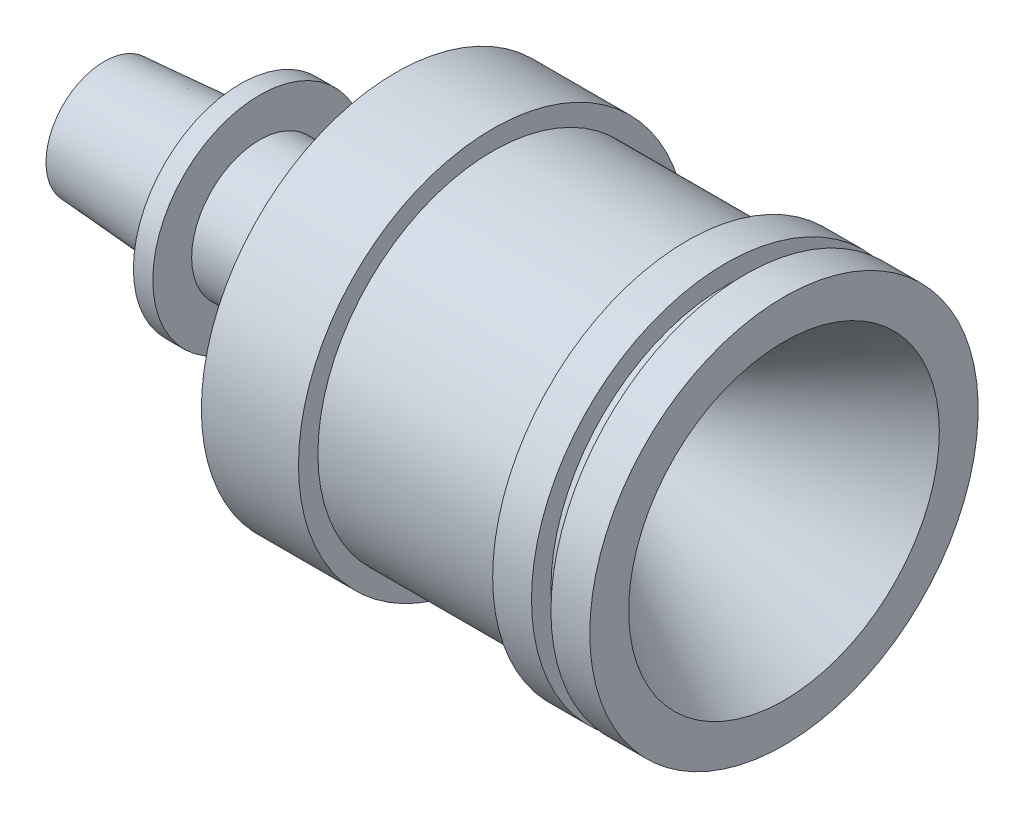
ISO-10303-21;
HEADER;
FILE_DESCRIPTION(('STEP AP214'),'2;1');
FILE_NAME('part.step','',(''),(''),'','','');
FILE_SCHEMA(('AUTOMOTIVE_DESIGN { 1 0 10303 214 1 1 1 1 }'));
ENDSEC;
DATA;
#1=APPLICATION_CONTEXT('core data for automotive mechanical design processes');
#2=APPLICATION_PROTOCOL_DEFINITION('international standard','automotive_design',2000,#1);
#3=PRODUCT_CONTEXT('',#1,'mechanical');
#4=PRODUCT('Part','Part','',(#3));
#5=PRODUCT_RELATED_PRODUCT_CATEGORY('part','',(#4));
#6=PRODUCT_DEFINITION_FORMATION('','',#4);
#7=PRODUCT_DEFINITION_CONTEXT('part definition',#1,'design');
#8=PRODUCT_DEFINITION('design','',#6,#7);
#9=PRODUCT_DEFINITION_SHAPE('','',#8);
#10=(LENGTH_UNIT() NAMED_UNIT(*) SI_UNIT(.MILLI.,.METRE.));
#11=(NAMED_UNIT(*) PLANE_ANGLE_UNIT() SI_UNIT($,.RADIAN.));
#12=(NAMED_UNIT(*) SI_UNIT($,.STERADIAN.) SOLID_ANGLE_UNIT());
#13=UNCERTAINTY_MEASURE_WITH_UNIT(LENGTH_MEASURE(1.E-05),#10,'distance_accuracy_value','');
#14=(GEOMETRIC_REPRESENTATION_CONTEXT(3) GLOBAL_UNCERTAINTY_ASSIGNED_CONTEXT((#13)) GLOBAL_UNIT_ASSIGNED_CONTEXT((#10,
#11,#12)) REPRESENTATION_CONTEXT('',''));
#15=CARTESIAN_POINT('',(0.,0.,0.));
#16=DIRECTION('',(0.,0.,1.));
#17=DIRECTION('',(1.,0.,0.));
#18=AXIS2_PLACEMENT_3D('',#15,#16,#17);
#19=CARTESIAN_POINT('',(25.,0.,0.));
#20=DIRECTION('',(-1.,0.,0.));
#21=DIRECTION('',(0.,1.,0.));
#22=AXIS2_PLACEMENT_3D('',#19,#20,#21);
#23=SPHERICAL_SURFACE('',#22,1.49999999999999);
#24=CARTESIAN_POINT('',(24.2066026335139,0.,0.));
#25=DIRECTION('',(-1.,0.,0.));
#26=DIRECTION('',(0.,0.,1.));
#27=AXIS2_PLACEMENT_3D('',#24,#25,#26);
#28=CIRCLE('',#27,1.27299670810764);
#29=CARTESIAN_POINT('',(24.2066026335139,0.,-1.27299670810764));
#30=VERTEX_POINT('',#29);
#31=EDGE_CURVE('E10',#30,#30,#28,.T.);
#32=ORIENTED_EDGE('',*,*,#31,.F.);
#33=EDGE_LOOP('',(#32));
#34=FACE_BOUND('',#33,.T.);
#35=ADVANCED_FACE('F29',(#34),#23,.F.);
#36=CARTESIAN_POINT('',(24.2066026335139,0.,0.));
#37=DIRECTION('',(1.,0.,0.));
#38=DIRECTION('',(0.,0.,-1.));
#39=AXIS2_PLACEMENT_3D('',#36,#37,#38);
#40=CONICAL_SURFACE('',#39,1.27299670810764,0.557341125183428);
#41=CARTESIAN_POINT('',(35.,0.,0.));
#42=DIRECTION('',(-1.,0.,0.));
#43=DIRECTION('',(0.,0.,1.));
#44=AXIS2_PLACEMENT_3D('',#41,#42,#43);
#45=CIRCLE('',#44,8.);
#46=CARTESIAN_POINT('',(35.,0.,-8.));
#47=VERTEX_POINT('',#46);
#48=EDGE_CURVE('E35',#47,#47,#45,.T.);
#49=CARTESIAN_POINT('',(35.,0.,-8.));
#50=CARTESIAN_POINT('',(34.8875687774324,0.,-7.92992704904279));
#51=CARTESIAN_POINT('',(34.7751375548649,0.,-7.85985409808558));
#52=CARTESIAN_POINT('',(34.5502751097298,0.,-7.71970819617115));
#53=CARTESIAN_POINT('',(34.4378438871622,0.,-7.64963524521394));
#54=CARTESIAN_POINT('',(34.2129814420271,0.,-7.50948934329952));
#55=CARTESIAN_POINT('',(34.1005502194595,0.,-7.4394163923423));
#56=CARTESIAN_POINT('',(33.8756877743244,0.,-7.29927049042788));
#57=CARTESIAN_POINT('',(33.7632565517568,0.,-7.22919753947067));
#58=CARTESIAN_POINT('',(33.5383941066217,0.,-7.08905163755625));
#59=CARTESIAN_POINT('',(33.4259628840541,0.,-7.01897868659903));
#60=CARTESIAN_POINT('',(33.201100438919,0.,-6.87883278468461));
#61=CARTESIAN_POINT('',(33.0886692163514,0.,-6.8087598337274));
#62=CARTESIAN_POINT('',(32.8638067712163,0.,-6.66861393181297));
#63=CARTESIAN_POINT('',(32.7513755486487,0.,-6.59854098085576));
#64=CARTESIAN_POINT('',(32.5265131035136,0.,-6.45839507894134));
#65=CARTESIAN_POINT('',(32.414081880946,0.,-6.38832212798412));
#66=CARTESIAN_POINT('',(32.1892194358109,0.,-6.2481762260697));
#67=CARTESIAN_POINT('',(32.0767882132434,0.,-6.17810327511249));
#68=CARTESIAN_POINT('',(31.8519257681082,0.,-6.03795737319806));
#69=CARTESIAN_POINT('',(31.7394945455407,0.,-5.96788442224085));
#70=CARTESIAN_POINT('',(31.5146321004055,0.,-5.82773852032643));
#71=CARTESIAN_POINT('',(31.402200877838,0.,-5.75766556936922));
#72=CARTESIAN_POINT('',(31.1773384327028,0.,-5.61751966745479));
#73=CARTESIAN_POINT('',(31.0649072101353,0.,-5.54744671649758));
#74=CARTESIAN_POINT('',(30.8400447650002,0.,-5.40730081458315));
#75=CARTESIAN_POINT('',(30.7276135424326,0.,-5.33722786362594));
#76=CARTESIAN_POINT('',(30.5027510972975,0.,-5.19708196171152));
#77=CARTESIAN_POINT('',(30.3903198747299,0.,-5.12700901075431));
#78=CARTESIAN_POINT('',(30.1654574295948,0.,-4.98686310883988));
#79=CARTESIAN_POINT('',(30.0530262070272,0.,-4.91679015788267));
#80=CARTESIAN_POINT('',(29.8281637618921,0.,-4.77664425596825));
#81=CARTESIAN_POINT('',(29.7157325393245,0.,-4.70657130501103));
#82=CARTESIAN_POINT('',(29.4908700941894,0.,-4.56642540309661));
#83=CARTESIAN_POINT('',(29.3784388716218,0.,-4.4963524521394));
#84=CARTESIAN_POINT('',(29.1535764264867,0.,-4.35620655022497));
#85=CARTESIAN_POINT('',(29.0411452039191,0.,-4.28613359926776));
#86=CARTESIAN_POINT('',(28.816282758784,0.,-4.14598769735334));
#87=CARTESIAN_POINT('',(28.7038515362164,0.,-4.07591474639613));
#88=CARTESIAN_POINT('',(28.4789890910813,0.,-3.9357688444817));
#89=CARTESIAN_POINT('',(28.3665578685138,0.,-3.86569589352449));
#90=CARTESIAN_POINT('',(28.1416954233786,0.,-3.72554999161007));
#91=CARTESIAN_POINT('',(28.0292642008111,0.,-3.65547704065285));
#92=CARTESIAN_POINT('',(27.8044017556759,0.,-3.51533113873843));
#93=CARTESIAN_POINT('',(27.6919705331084,0.,-3.44525818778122));
#94=CARTESIAN_POINT('',(27.4671080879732,0.,-3.30511228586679));
#95=CARTESIAN_POINT('',(27.3546768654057,0.,-3.23503933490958));
#96=CARTESIAN_POINT('',(27.1298144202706,0.,-3.09489343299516));
#97=CARTESIAN_POINT('',(27.017383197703,0.,-3.02482048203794));
#98=CARTESIAN_POINT('',(26.7925207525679,0.,-2.88467458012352));
#99=CARTESIAN_POINT('',(26.6800895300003,0.,-2.81460162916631));
#100=CARTESIAN_POINT('',(26.4552270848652,0.,-2.67445572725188));
#101=CARTESIAN_POINT('',(26.3427958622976,0.,-2.60438277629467));
#102=CARTESIAN_POINT('',(26.1179334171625,0.,-2.46423687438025));
#103=CARTESIAN_POINT('',(26.0055021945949,0.,-2.39416392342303));
#104=CARTESIAN_POINT('',(25.7806397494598,0.,-2.25401802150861));
#105=CARTESIAN_POINT('',(25.6682085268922,0.,-2.1839450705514));
#106=CARTESIAN_POINT('',(25.4433460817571,0.,-2.04379916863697));
#107=CARTESIAN_POINT('',(25.3309148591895,0.,-1.97372621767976));
#108=CARTESIAN_POINT('',(25.1060524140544,0.,-1.83358031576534));
#109=CARTESIAN_POINT('',(24.9936211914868,0.,-1.76350736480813));
#110=CARTESIAN_POINT('',(24.7687587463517,0.,-1.6233614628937));
#111=CARTESIAN_POINT('',(24.6563275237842,0.,-1.55328851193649));
#112=CARTESIAN_POINT('',(24.431465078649,0.,-1.41314261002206));
#113=CARTESIAN_POINT('',(24.3190338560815,0.,-1.34306965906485));
#114=CARTESIAN_POINT('',(24.2066026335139,0.,-1.27299670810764));
#115=B_SPLINE_CURVE_WITH_KNOTS('',3,(#49,#50,#51,#52,#53,#54,#55,#56,#57,#58,#59,#60,#61,#62,
#63,#64,#65,#66,#67,#68,#69,#70,#71,#72,#73,#74,#75,#76,#77,#78,#79,#80,#81,#82,#83,#84,#85,#86,
#87,#88,#89,#90,#91,#92,#93,#94,#95,#96,#97,#98,#99,#100,#101,#102,#103,#104,#105,#106,#107,
#108,#109,#110,#111,#112,#113,#114),.UNSPECIFIED.,.F.,.F.,(4,2,2,2,2,2,2,2,2,2,2,2,2,2,2,2,2,2,
2,2,2,2,2,2,2,2,2,2,2,2,2,2,4),(0.,0.397440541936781,0.794881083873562,1.19232162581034,
1.58976216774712,1.98720270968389,2.38464325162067,2.78208379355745,3.17952433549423,
3.57696487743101,3.97440541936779,4.37184596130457,4.76928650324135,5.16672704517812,
5.5641675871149,5.96160812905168,6.35904867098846,6.75648921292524,7.15392975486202,
7.55137029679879,7.94881083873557,8.34625138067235,8.74369192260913,9.1411324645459,
9.53857300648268,9.93601354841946,10.3334540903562,10.730894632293,11.1283351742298,
11.5257757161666,11.9232162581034,12.3206568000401,12.7180973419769),.UNSPECIFIED.);
#116=EDGE_CURVE('BSEAM185',#47,#30,#115,.T.);
#117=ORIENTED_EDGE('',*,*,#48,.F.);
#118=ORIENTED_EDGE('',*,*,#31,.T.);
#119=ORIENTED_EDGE('',*,*,#116,.T.);
#120=ORIENTED_EDGE('',*,*,#116,.F.);
#121=EDGE_LOOP('',(#117,#119,#118,#120));
#122=FACE_BOUND('',#121,.T.);
#123=ADVANCED_FACE('F185',(#122),#40,.F.);
#124=CARTESIAN_POINT('',(35.,10.,0.));
#125=DIRECTION('',(-1.,0.,0.));
#126=DIRECTION('',(0.,0.,1.));
#127=AXIS2_PLACEMENT_3D('',#124,#125,#126);
#128=PLANE('',#127);
#129=CARTESIAN_POINT('',(35.,0.,0.));
#130=DIRECTION('',(-1.,0.,0.));
#131=DIRECTION('',(0.,0.,1.));
#132=AXIS2_PLACEMENT_3D('',#129,#130,#131);
#133=CIRCLE('',#132,10.);
#134=CARTESIAN_POINT('',(35.,0.,10.));
#135=VERTEX_POINT('',#134);
#136=EDGE_CURVE('E39',#135,#135,#133,.T.);
#137=ORIENTED_EDGE('',*,*,#136,.F.);
#138=EDGE_LOOP('',(#137));
#139=FACE_BOUND('',#138,.T.);
#140=ORIENTED_EDGE('',*,*,#48,.T.);
#141=EDGE_LOOP('',(#140));
#142=FACE_BOUND('',#141,.T.);
#143=ADVANCED_FACE('F180',(#139,#142),#128,.F.);
#144=CARTESIAN_POINT('',(0.,0.,0.));
#145=DIRECTION('',(-1.,0.,0.));
#146=DIRECTION('',(0.,0.,1.));
#147=AXIS2_PLACEMENT_3D('',#144,#145,#146);
#148=CYLINDRICAL_SURFACE('',#147,10.);
#149=CARTESIAN_POINT('',(33.,0.,0.));
#150=DIRECTION('',(-1.,0.,0.));
#151=DIRECTION('',(0.,0.,1.));
#152=AXIS2_PLACEMENT_3D('',#149,#150,#151);
#153=CIRCLE('',#152,10.);
#154=CARTESIAN_POINT('',(33.,0.,10.));
#155=VERTEX_POINT('',#154);
#156=EDGE_CURVE('E43',#155,#155,#153,.T.);
#157=ORIENTED_EDGE('',*,*,#156,.F.);
#158=EDGE_LOOP('',(#157));
#159=FACE_BOUND('',#158,.T.);
#160=ORIENTED_EDGE('',*,*,#136,.T.);
#161=EDGE_LOOP('',(#160));
#162=FACE_BOUND('',#161,.T.);
#163=ADVANCED_FACE('F174',(#159,#162),#148,.T.);
#164=CARTESIAN_POINT('',(33.,9.,0.));
#165=DIRECTION('',(1.,0.,0.));
#166=DIRECTION('',(0.,0.,-1.));
#167=AXIS2_PLACEMENT_3D('',#164,#165,#166);
#168=PLANE('',#167);
#169=CARTESIAN_POINT('',(33.,0.,0.));
#170=DIRECTION('',(-1.,0.,0.));
#171=DIRECTION('',(0.,0.,1.));
#172=AXIS2_PLACEMENT_3D('',#169,#170,#171);
#173=CIRCLE('',#172,9.);
#174=CARTESIAN_POINT('',(33.,0.,9.));
#175=VERTEX_POINT('',#174);
#176=EDGE_CURVE('E48',#175,#175,#173,.T.);
#177=ORIENTED_EDGE('',*,*,#176,.F.);
#178=EDGE_LOOP('',(#177));
#179=FACE_BOUND('',#178,.T.);
#180=ORIENTED_EDGE('',*,*,#156,.T.);
#181=EDGE_LOOP('',(#180));
#182=FACE_BOUND('',#181,.T.);
#183=ADVANCED_FACE('F168',(#179,#182),#168,.F.);
#184=CARTESIAN_POINT('',(0.,0.,0.));
#185=DIRECTION('',(-1.,0.,0.));
#186=DIRECTION('',(0.,0.,1.));
#187=AXIS2_PLACEMENT_3D('',#184,#185,#186);
#188=CYLINDRICAL_SURFACE('',#187,9.);
#189=CARTESIAN_POINT('',(32.,0.,0.));
#190=DIRECTION('',(-1.,0.,0.));
#191=DIRECTION('',(0.,0.,1.));
#192=AXIS2_PLACEMENT_3D('',#189,#190,#191);
#193=CIRCLE('',#192,9.);
#194=CARTESIAN_POINT('',(32.,0.,9.));
#195=VERTEX_POINT('',#194);
#196=EDGE_CURVE('E51',#195,#195,#193,.T.);
#197=ORIENTED_EDGE('',*,*,#196,.F.);
#198=EDGE_LOOP('',(#197));
#199=FACE_BOUND('',#198,.T.);
#200=ORIENTED_EDGE('',*,*,#176,.T.);
#201=EDGE_LOOP('',(#200));
#202=FACE_BOUND('',#201,.T.);
#203=ADVANCED_FACE('F162',(#199,#202),#188,.T.);
#204=CARTESIAN_POINT('',(32.,10.,0.));
#205=DIRECTION('',(-1.,0.,0.));
#206=DIRECTION('',(0.,0.,1.));
#207=AXIS2_PLACEMENT_3D('',#204,#205,#206);
#208=PLANE('',#207);
#209=CARTESIAN_POINT('',(32.,0.,0.));
#210=DIRECTION('',(-1.,0.,0.));
#211=DIRECTION('',(0.,0.,1.));
#212=AXIS2_PLACEMENT_3D('',#209,#210,#211);
#213=CIRCLE('',#212,10.);
#214=CARTESIAN_POINT('',(32.,0.,10.));
#215=VERTEX_POINT('',#214);
#216=EDGE_CURVE('E54',#215,#215,#213,.T.);
#217=ORIENTED_EDGE('',*,*,#216,.F.);
#218=EDGE_LOOP('',(#217));
#219=FACE_BOUND('',#218,.T.);
#220=ORIENTED_EDGE('',*,*,#196,.T.);
#221=EDGE_LOOP('',(#220));
#222=FACE_BOUND('',#221,.T.);
#223=ADVANCED_FACE('F156',(#219,#222),#208,.F.);
#224=CARTESIAN_POINT('',(0.,0.,0.));
#225=DIRECTION('',(-1.,0.,0.));
#226=DIRECTION('',(0.,0.,1.));
#227=AXIS2_PLACEMENT_3D('',#224,#225,#226);
#228=CYLINDRICAL_SURFACE('',#227,10.);
#229=CARTESIAN_POINT('',(30.,0.,0.));
#230=DIRECTION('',(-1.,0.,0.));
#231=DIRECTION('',(0.,0.,1.));
#232=AXIS2_PLACEMENT_3D('',#229,#230,#231);
#233=CIRCLE('',#232,10.);
#234=CARTESIAN_POINT('',(30.,0.,10.));
#235=VERTEX_POINT('',#234);
#236=EDGE_CURVE('E57',#235,#235,#233,.T.);
#237=ORIENTED_EDGE('',*,*,#236,.F.);
#238=EDGE_LOOP('',(#237));
#239=FACE_BOUND('',#238,.T.);
#240=ORIENTED_EDGE('',*,*,#216,.T.);
#241=EDGE_LOOP('',(#240));
#242=FACE_BOUND('',#241,.T.);
#243=ADVANCED_FACE('F150',(#239,#242),#228,.T.);
#244=CARTESIAN_POINT('',(30.,9.,0.));
#245=DIRECTION('',(1.,0.,0.));
#246=DIRECTION('',(0.,0.,-1.));
#247=AXIS2_PLACEMENT_3D('',#244,#245,#246);
#248=PLANE('',#247);
#249=CARTESIAN_POINT('',(30.,0.,0.));
#250=DIRECTION('',(-1.,0.,0.));
#251=DIRECTION('',(0.,0.,1.));
#252=AXIS2_PLACEMENT_3D('',#249,#250,#251);
#253=CIRCLE('',#252,9.);
#254=CARTESIAN_POINT('',(30.,0.,9.));
#255=VERTEX_POINT('',#254);
#256=EDGE_CURVE('E60',#255,#255,#253,.T.);
#257=ORIENTED_EDGE('',*,*,#256,.F.);
#258=EDGE_LOOP('',(#257));
#259=FACE_BOUND('',#258,.T.);
#260=ORIENTED_EDGE('',*,*,#236,.T.);
#261=EDGE_LOOP('',(#260));
#262=FACE_BOUND('',#261,.T.);
#263=ADVANCED_FACE('F144',(#259,#262),#248,.F.);
#264=CARTESIAN_POINT('',(0.,0.,0.));
#265=DIRECTION('',(-1.,0.,0.));
#266=DIRECTION('',(0.,0.,1.));
#267=AXIS2_PLACEMENT_3D('',#264,#265,#266);
#268=CYLINDRICAL_SURFACE('',#267,9.);
#269=CARTESIAN_POINT('',(20.,0.,0.));
#270=DIRECTION('',(-1.,0.,0.));
#271=DIRECTION('',(0.,0.,1.));
#272=AXIS2_PLACEMENT_3D('',#269,#270,#271);
#273=CIRCLE('',#272,9.);
#274=CARTESIAN_POINT('',(20.,0.,9.));
#275=VERTEX_POINT('',#274);
#276=EDGE_CURVE('E63',#275,#275,#273,.T.);
#277=ORIENTED_EDGE('',*,*,#276,.F.);
#278=EDGE_LOOP('',(#277));
#279=FACE_BOUND('',#278,.T.);
#280=ORIENTED_EDGE('',*,*,#256,.T.);
#281=EDGE_LOOP('',(#280));
#282=FACE_BOUND('',#281,.T.);
#283=ADVANCED_FACE('F138',(#279,#282),#268,.T.);
#284=CARTESIAN_POINT('',(20.,10.,0.));
#285=DIRECTION('',(-1.,0.,0.));
#286=DIRECTION('',(0.,0.,1.));
#287=AXIS2_PLACEMENT_3D('',#284,#285,#286);
#288=PLANE('',#287);
#289=CARTESIAN_POINT('',(20.,0.,0.));
#290=DIRECTION('',(-1.,0.,0.));
#291=DIRECTION('',(0.,0.,1.));
#292=AXIS2_PLACEMENT_3D('',#289,#290,#291);
#293=CIRCLE('',#292,10.);
#294=CARTESIAN_POINT('',(20.,0.,10.));
#295=VERTEX_POINT('',#294);
#296=EDGE_CURVE('E66',#295,#295,#293,.T.);
#297=ORIENTED_EDGE('',*,*,#296,.F.);
#298=EDGE_LOOP('',(#297));
#299=FACE_BOUND('',#298,.T.);
#300=ORIENTED_EDGE('',*,*,#276,.T.);
#301=EDGE_LOOP('',(#300));
#302=FACE_BOUND('',#301,.T.);
#303=ADVANCED_FACE('F132',(#299,#302),#288,.F.);
#304=CARTESIAN_POINT('',(0.,0.,0.));
#305=DIRECTION('',(-1.,0.,0.));
#306=DIRECTION('',(0.,0.,1.));
#307=AXIS2_PLACEMENT_3D('',#304,#305,#306);
#308=CYLINDRICAL_SURFACE('',#307,10.);
#309=CARTESIAN_POINT('',(15.,0.,0.));
#310=DIRECTION('',(-1.,0.,0.));
#311=DIRECTION('',(0.,0.,1.));
#312=AXIS2_PLACEMENT_3D('',#309,#310,#311);
#313=CIRCLE('',#312,10.);
#314=CARTESIAN_POINT('',(15.,0.,10.));
#315=VERTEX_POINT('',#314);
#316=EDGE_CURVE('E69',#315,#315,#313,.T.);
#317=ORIENTED_EDGE('',*,*,#316,.F.);
#318=EDGE_LOOP('',(#317));
#319=FACE_BOUND('',#318,.T.);
#320=ORIENTED_EDGE('',*,*,#296,.T.);
#321=EDGE_LOOP('',(#320));
#322=FACE_BOUND('',#321,.T.);
#323=ADVANCED_FACE('F126',(#319,#322),#308,.T.);
#324=CARTESIAN_POINT('',(15.,3.5,0.));
#325=DIRECTION('',(1.,0.,0.));
#326=DIRECTION('',(0.,0.,-1.));
#327=AXIS2_PLACEMENT_3D('',#324,#325,#326);
#328=PLANE('',#327);
#329=CARTESIAN_POINT('',(15.,0.,0.));
#330=DIRECTION('',(-1.,0.,0.));
#331=DIRECTION('',(0.,0.,1.));
#332=AXIS2_PLACEMENT_3D('',#329,#330,#331);
#333=CIRCLE('',#332,3.5);
#334=CARTESIAN_POINT('',(15.,0.,3.5));
#335=VERTEX_POINT('',#334);
#336=EDGE_CURVE('E72',#335,#335,#333,.T.);
#337=ORIENTED_EDGE('',*,*,#336,.F.);
#338=EDGE_LOOP('',(#337));
#339=FACE_BOUND('',#338,.T.);
#340=ORIENTED_EDGE('',*,*,#316,.T.);
#341=EDGE_LOOP('',(#340));
#342=FACE_BOUND('',#341,.T.);
#343=ADVANCED_FACE('F120',(#339,#342),#328,.F.);
#344=CARTESIAN_POINT('',(0.,0.,0.));
#345=DIRECTION('',(-1.,0.,0.));
#346=DIRECTION('',(0.,0.,1.));
#347=AXIS2_PLACEMENT_3D('',#344,#345,#346);
#348=CYLINDRICAL_SURFACE('',#347,3.5);
#349=CARTESIAN_POINT('',(8.,0.,0.));
#350=DIRECTION('',(-1.,0.,0.));
#351=DIRECTION('',(0.,0.,1.));
#352=AXIS2_PLACEMENT_3D('',#349,#350,#351);
#353=CIRCLE('',#352,3.5);
#354=CARTESIAN_POINT('',(8.,0.,3.5));
#355=VERTEX_POINT('',#354);
#356=EDGE_CURVE('E75',#355,#355,#353,.T.);
#357=ORIENTED_EDGE('',*,*,#356,.F.);
#358=EDGE_LOOP('',(#357));
#359=FACE_BOUND('',#358,.T.);
#360=ORIENTED_EDGE('',*,*,#336,.T.);
#361=EDGE_LOOP('',(#360));
#362=FACE_BOUND('',#361,.T.);
#363=ADVANCED_FACE('F114',(#359,#362),#348,.T.);
#364=CARTESIAN_POINT('',(8.,5.5,0.));
#365=DIRECTION('',(-1.,0.,0.));
#366=DIRECTION('',(0.,0.,1.));
#367=AXIS2_PLACEMENT_3D('',#364,#365,#366);
#368=PLANE('',#367);
#369=CARTESIAN_POINT('',(8.,0.,0.));
#370=DIRECTION('',(-1.,0.,0.));
#371=DIRECTION('',(0.,0.,1.));
#372=AXIS2_PLACEMENT_3D('',#369,#370,#371);
#373=CIRCLE('',#372,5.5);
#374=CARTESIAN_POINT('',(8.,0.,5.5));
#375=VERTEX_POINT('',#374);
#376=EDGE_CURVE('E78',#375,#375,#373,.T.);
#377=ORIENTED_EDGE('',*,*,#376,.F.);
#378=EDGE_LOOP('',(#377));
#379=FACE_BOUND('',#378,.T.);
#380=ORIENTED_EDGE('',*,*,#356,.T.);
#381=EDGE_LOOP('',(#380));
#382=FACE_BOUND('',#381,.T.);
#383=ADVANCED_FACE('F108',(#379,#382),#368,.F.);
#384=CARTESIAN_POINT('',(0.,0.,0.));
#385=DIRECTION('',(-1.,0.,0.));
#386=DIRECTION('',(0.,0.,1.));
#387=AXIS2_PLACEMENT_3D('',#384,#385,#386);
#388=CYLINDRICAL_SURFACE('',#387,5.5);
#389=CARTESIAN_POINT('',(7.,0.,0.));
#390=DIRECTION('',(-1.,0.,0.));
#391=DIRECTION('',(0.,0.,1.));
#392=AXIS2_PLACEMENT_3D('',#389,#390,#391);
#393=CIRCLE('',#392,5.5);
#394=CARTESIAN_POINT('',(7.,0.,5.5));
#395=VERTEX_POINT('',#394);
#396=EDGE_CURVE('E81',#395,#395,#393,.T.);
#397=ORIENTED_EDGE('',*,*,#396,.F.);
#398=EDGE_LOOP('',(#397));
#399=FACE_BOUND('',#398,.T.);
#400=ORIENTED_EDGE('',*,*,#376,.T.);
#401=EDGE_LOOP('',(#400));
#402=FACE_BOUND('',#401,.T.);
#403=ADVANCED_FACE('F102',(#399,#402),#388,.T.);
#404=CARTESIAN_POINT('',(7.,3.5,0.));
#405=DIRECTION('',(1.,0.,0.));
#406=DIRECTION('',(0.,0.,-1.));
#407=AXIS2_PLACEMENT_3D('',#404,#405,#406);
#408=PLANE('',#407);
#409=CARTESIAN_POINT('',(7.,0.,0.));
#410=DIRECTION('',(-1.,0.,0.));
#411=DIRECTION('',(0.,0.,1.));
#412=AXIS2_PLACEMENT_3D('',#409,#410,#411);
#413=CIRCLE('',#412,3.5);
#414=CARTESIAN_POINT('',(7.,0.,3.5));
#415=VERTEX_POINT('',#414);
#416=EDGE_CURVE('E84',#415,#415,#413,.T.);
#417=ORIENTED_EDGE('',*,*,#416,.F.);
#418=EDGE_LOOP('',(#417));
#419=FACE_BOUND('',#418,.T.);
#420=ORIENTED_EDGE('',*,*,#396,.T.);
#421=EDGE_LOOP('',(#420));
#422=FACE_BOUND('',#421,.T.);
#423=ADVANCED_FACE('F96',(#419,#422),#408,.F.);
#424=CARTESIAN_POINT('',(7.,0.,0.));
#425=DIRECTION('',(1.,0.,0.));
#426=DIRECTION('',(0.,0.,-1.));
#427=AXIS2_PLACEMENT_3D('',#424,#425,#426);
#428=CONICAL_SURFACE('',#427,3.5,0.0713074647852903);
#429=CARTESIAN_POINT('',(0.,0.,0.));
#430=DIRECTION('',(-1.,0.,0.));
#431=DIRECTION('',(0.,0.,1.));
#432=AXIS2_PLACEMENT_3D('',#429,#430,#431);
#433=CIRCLE('',#432,3.);
#434=CARTESIAN_POINT('',(0.,0.,3.));
#435=VERTEX_POINT('',#434);
#436=EDGE_CURVE('E87',#435,#435,#433,.T.);
#437=ORIENTED_EDGE('',*,*,#436,.F.);
#438=EDGE_LOOP('',(#437));
#439=FACE_BOUND('',#438,.T.);
#440=ORIENTED_EDGE('',*,*,#416,.T.);
#441=EDGE_LOOP('',(#440));
#442=FACE_BOUND('',#441,.T.);
#443=ADVANCED_FACE('F93',(#439,#442),#428,.T.);
#444=CARTESIAN_POINT('',(0.,0.,0.));
#445=DIRECTION('',(1.,0.,0.));
#446=DIRECTION('',(0.,0.,-1.));
#447=AXIS2_PLACEMENT_3D('',#444,#445,#446);
#448=PLANE('',#447);
#449=ORIENTED_EDGE('',*,*,#436,.T.);
#450=EDGE_LOOP('',(#449));
#451=FACE_BOUND('',#450,.T.);
#452=ADVANCED_FACE('F91',(#451),#448,.F.);
#453=CLOSED_SHELL('',(#35,#123,#143,#163,#183,#203,#223,#243,#263,#283,#303,#323,#343,#363,#383,
#403,#423,#443,#452));
#454=MANIFOLD_SOLID_BREP('B2',#453);
#455=ADVANCED_BREP_SHAPE_REPRESENTATION('',(#18,#454),#14);
#456=SHAPE_DEFINITION_REPRESENTATION(#9,#455);
ENDSEC;
END-ISO-10303-21;
